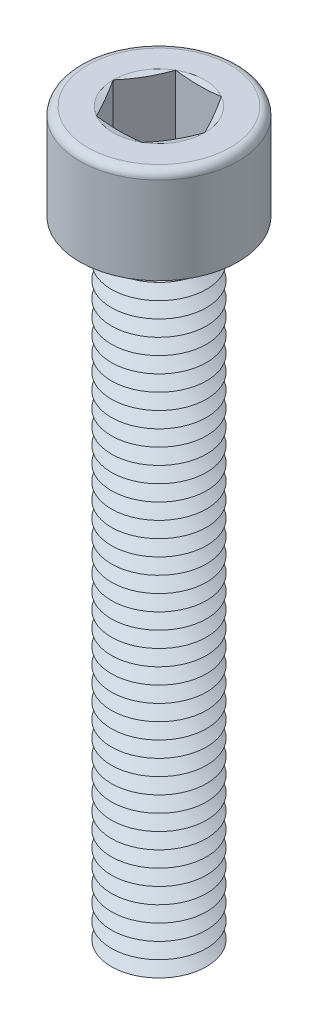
from build123d import *

# Parameters (mm, degrees)
SKETCH1_R       = 3
EXTRUDE1_DEPTH  = 40
SKETCH2_R       = 5
EXTRUDE2_DEPTH  = 6
EXTRUDE3_DEPTH  = 5
FILLET1_R       = 0.5
LPATTERN1_COUNT = 40
LPATTERN1_PITCH = 1


with BuildPart() as part:
    # Sketch1 → Extrude1 (new body)
    with BuildSketch(Plane(origin=(0, 0, 0), x_dir=(1, 0, 0), z_dir=(0, 1, 0))):
        with Locations(Location((0, 0, 0), (0, 0, 270))):
            Circle(SKETCH1_R)
    extrude(amount=EXTRUDE1_DEPTH)

    # Sketch2 → Extrude2 (add)
    with BuildSketch(Plane(origin=(0, 40, 0), x_dir=(1, 0, 0), z_dir=(0, 1, 0))):
        with Locations(Location((0, 0, 0), (0, 0, 270))):
            Circle(SKETCH2_R)
    extrude(amount=EXTRUDE2_DEPTH)

    # Sketch3 → Extrude3 (cut)
    with BuildSketch(Plane(origin=(0, 46, 0), x_dir=(1, 0, 0), z_dir=(0, 1, 0))):
        Polygon((1.443375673, 2.5), (-1.443375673, 2.5), (-2.886751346, 0), (-1.443375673, -2.5), (1.443375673, -2.5), (2.886751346, 0), align=None)
    extrude(amount=-EXTRUDE3_DEPTH, mode=Mode.SUBTRACT)

    # Fillet1
    fillet1_edges = [part.edges().sort_by_distance(p)[0] for p in [
        (0, 46, -5),
    ]]
    fillet(fillet1_edges, radius=FILLET1_R)

    # Sketch4 → Cut-Revolve1 (revolve, cut)
    with BuildSketch(Plane(origin=(0, 0, 0), x_dir=(0, 0, -1), z_dir=(1, 0, 0))):
        Polygon((-2.5, 41), (0, 41), (0, 39.556624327), align=None)
    revolve(axis=Axis((0, 41, 0), (0, -1, 0)), mode=Mode.SUBTRACT)

    # Sketch5 → Cut-Revolve2 (revolve, cut)
    with BuildSketch(Plane.XY, mode=Mode.PRIVATE) as cut_revolve2_sk:
        Polygon((-3, 0.5), (-3, -0.5), (-2.133974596, 0), align=None)
    cut_revolve2 = revolve(cut_revolve2_sk.sketch.rotate(Axis((0, 40, 0), (0, -1, 0)), 270), axis=Axis((0, 40, 0), (0, -1, 0)), mode=Mode.SUBTRACT)

    # LPattern1: Cut-Revolve2 ×40
    with Locations(*[(0, i * LPATTERN1_PITCH, 0) for i in range(1, LPATTERN1_COUNT)]):
        add(cut_revolve2, mode=Mode.SUBTRACT)

    # Extrude4 cone 1 section (on through the dimple's axis) → Extrude4 (revolve, cut)
    with BuildSketch(Plane(origin=(0, 46, 0), x_dir=(0, 0, 1), z_dir=(1, 0, 0))):
        Polygon((0, 0), (2.886751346, 0), (0, 0.773502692), align=None)
    revolve(axis=Axis((0, 46, 0), (0, -1, 0)), mode=Mode.SUBTRACT)


solid = part.part
